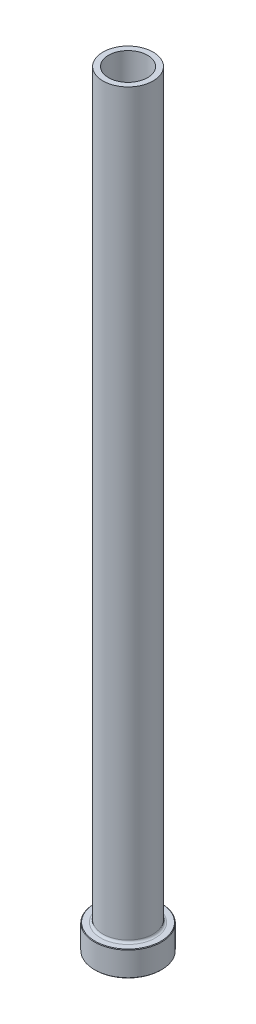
ISO-10303-21;
HEADER;
FILE_DESCRIPTION(('STEP AP214'),'2;1');
FILE_NAME('part.step','',(''),(''),'','','');
FILE_SCHEMA(('AUTOMOTIVE_DESIGN { 1 0 10303 214 1 1 1 1 }'));
ENDSEC;
DATA;
#1=APPLICATION_CONTEXT('core data for automotive mechanical design processes');
#2=APPLICATION_PROTOCOL_DEFINITION('international standard','automotive_design',2000,#1);
#3=PRODUCT_CONTEXT('',#1,'mechanical');
#4=PRODUCT('Part','Part','',(#3));
#5=PRODUCT_RELATED_PRODUCT_CATEGORY('part','',(#4));
#6=PRODUCT_DEFINITION_FORMATION('','',#4);
#7=PRODUCT_DEFINITION_CONTEXT('part definition',#1,'design');
#8=PRODUCT_DEFINITION('design','',#6,#7);
#9=PRODUCT_DEFINITION_SHAPE('','',#8);
#10=(LENGTH_UNIT() NAMED_UNIT(*) SI_UNIT(.MILLI.,.METRE.));
#11=(NAMED_UNIT(*) PLANE_ANGLE_UNIT() SI_UNIT($,.RADIAN.));
#12=(NAMED_UNIT(*) SI_UNIT($,.STERADIAN.) SOLID_ANGLE_UNIT());
#13=UNCERTAINTY_MEASURE_WITH_UNIT(LENGTH_MEASURE(1.E-05),#10,'distance_accuracy_value','');
#14=(GEOMETRIC_REPRESENTATION_CONTEXT(3) GLOBAL_UNCERTAINTY_ASSIGNED_CONTEXT((#13)) GLOBAL_UNIT_ASSIGNED_CONTEXT((#10,
#11,#12)) REPRESENTATION_CONTEXT('',''));
#15=CARTESIAN_POINT('',(0.,0.,0.));
#16=DIRECTION('',(0.,0.,1.));
#17=DIRECTION('',(1.,0.,0.));
#18=AXIS2_PLACEMENT_3D('',#15,#16,#17);
#19=CARTESIAN_POINT('',(0.,92.1876809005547,0.));
#20=DIRECTION('',(0.,1.,0.));
#21=DIRECTION('',(0.,0.,1.));
#22=AXIS2_PLACEMENT_3D('',#19,#20,#21);
#23=CYLINDRICAL_SURFACE('',#22,7.00000000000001);
#24=CARTESIAN_POINT('',(0.,275.,0.));
#25=DIRECTION('',(0.,1.,0.));
#26=DIRECTION('',(0.,0.,1.));
#27=AXIS2_PLACEMENT_3D('',#24,#25,#26);
#28=CIRCLE('',#27,7.00000000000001);
#29=CARTESIAN_POINT('',(0.,275.,7.00000000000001));
#30=VERTEX_POINT('',#29);
#31=EDGE_CURVE('E62',#30,#30,#28,.T.);
#32=ORIENTED_EDGE('',*,*,#31,.T.);
#33=EDGE_LOOP('',(#32));
#34=FACE_BOUND('',#33,.T.);
#35=CARTESIAN_POINT('',(0.,220.,0.));
#36=DIRECTION('',(0.,1.,0.));
#37=DIRECTION('',(0.,0.,1.));
#38=AXIS2_PLACEMENT_3D('',#35,#36,#37);
#39=CIRCLE('',#38,7.00000000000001);
#40=CARTESIAN_POINT('',(0.,220.,7.00000000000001));
#41=VERTEX_POINT('',#40);
#42=EDGE_CURVE('E71',#41,#41,#39,.T.);
#43=ORIENTED_EDGE('',*,*,#42,.F.);
#44=EDGE_LOOP('',(#43));
#45=FACE_BOUND('',#44,.T.);
#46=ADVANCED_FACE('F30',(#34,#45),#23,.F.);
#47=CARTESIAN_POINT('',(-7.00000000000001,275.,0.));
#48=DIRECTION('',(0.,1.,0.));
#49=DIRECTION('',(0.,0.,1.));
#50=AXIS2_PLACEMENT_3D('',#47,#48,#49);
#51=PLANE('',#50);
#52=CARTESIAN_POINT('',(0.,275.,0.));
#53=DIRECTION('',(0.,1.,0.));
#54=DIRECTION('',(0.,0.,1.));
#55=AXIS2_PLACEMENT_3D('',#52,#53,#54);
#56=CIRCLE('',#55,9.00000000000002);
#57=CARTESIAN_POINT('',(0.,275.,9.00000000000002));
#58=VERTEX_POINT('',#57);
#59=EDGE_CURVE('E65',#58,#58,#56,.T.);
#60=ORIENTED_EDGE('',*,*,#59,.T.);
#61=EDGE_LOOP('',(#60));
#62=FACE_BOUND('',#61,.T.);
#63=ORIENTED_EDGE('',*,*,#31,.F.);
#64=EDGE_LOOP('',(#63));
#65=FACE_BOUND('',#64,.T.);
#66=ADVANCED_FACE('F79',(#62,#65),#51,.T.);
#67=CARTESIAN_POINT('',(0.,92.1876809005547,0.));
#68=DIRECTION('',(0.,1.,0.));
#69=DIRECTION('',(0.,0.,1.));
#70=AXIS2_PLACEMENT_3D('',#67,#68,#69);
#71=CYLINDRICAL_SURFACE('',#70,9.00000000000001);
#72=CARTESIAN_POINT('',(0.,9.8,0.));
#73=DIRECTION('',(0.,1.,0.));
#74=DIRECTION('',(0.,0.,1.));
#75=AXIS2_PLACEMENT_3D('',#72,#73,#74);
#76=CIRCLE('',#75,9.00000000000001);
#77=CARTESIAN_POINT('',(0.,9.8,9.00000000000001));
#78=VERTEX_POINT('',#77);
#79=EDGE_CURVE('E59',#78,#78,#76,.T.);
#80=ORIENTED_EDGE('',*,*,#79,.T.);
#81=EDGE_LOOP('',(#80));
#82=FACE_BOUND('',#81,.T.);
#83=ORIENTED_EDGE('',*,*,#59,.F.);
#84=EDGE_LOOP('',(#83));
#85=FACE_BOUND('',#84,.T.);
#86=ADVANCED_FACE('F85',(#82,#85),#71,.T.);
#87=CARTESIAN_POINT('',(-8.99999999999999,9.,0.));
#88=DIRECTION('',(0.,1.,0.));
#89=DIRECTION('',(0.,0.,1.));
#90=AXIS2_PLACEMENT_3D('',#87,#88,#89);
#91=PLANE('',#90);
#92=CARTESIAN_POINT('',(0.,9.,0.));
#93=DIRECTION('',(0.,1.,0.));
#94=DIRECTION('',(0.,0.,1.));
#95=AXIS2_PLACEMENT_3D('',#92,#93,#94);
#96=CIRCLE('',#95,11.8);
#97=CARTESIAN_POINT('',(0.,9.,-11.8));
#98=VERTEX_POINT('',#97);
#99=EDGE_CURVE('E53',#98,#98,#96,.T.);
#100=ORIENTED_EDGE('',*,*,#99,.T.);
#101=EDGE_LOOP('',(#100));
#102=FACE_BOUND('',#101,.T.);
#103=CARTESIAN_POINT('',(0.,9.,0.));
#104=DIRECTION('',(0.,1.,0.));
#105=DIRECTION('',(0.,0.,1.));
#106=AXIS2_PLACEMENT_3D('',#103,#104,#105);
#107=CIRCLE('',#106,9.8);
#108=CARTESIAN_POINT('',(0.,9.,9.8));
#109=VERTEX_POINT('',#108);
#110=EDGE_CURVE('E56',#109,#109,#107,.F.);
#111=ORIENTED_EDGE('',*,*,#110,.T.);
#112=EDGE_LOOP('',(#111));
#113=FACE_BOUND('',#112,.T.);
#114=ADVANCED_FACE('F111',(#102,#113),#91,.T.);
#115=CARTESIAN_POINT('',(0.,92.1876809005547,0.));
#116=DIRECTION('',(0.,1.,0.));
#117=DIRECTION('',(0.,0.,1.));
#118=AXIS2_PLACEMENT_3D('',#115,#116,#117);
#119=CYLINDRICAL_SURFACE('',#118,12.);
#120=CARTESIAN_POINT('',(0.,8.80000000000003,0.));
#121=DIRECTION('',(0.,1.,0.));
#122=DIRECTION('',(0.,0.,1.));
#123=AXIS2_PLACEMENT_3D('',#120,#121,#122);
#124=CIRCLE('',#123,12.);
#125=CARTESIAN_POINT('',(0.,8.80000000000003,-12.));
#126=VERTEX_POINT('',#125);
#127=EDGE_CURVE('E45',#126,#126,#124,.F.);
#128=ORIENTED_EDGE('',*,*,#127,.T.);
#129=EDGE_LOOP('',(#128));
#130=FACE_BOUND('',#129,.T.);
#131=CARTESIAN_POINT('',(0.,0.200000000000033,0.));
#132=DIRECTION('',(0.,-1.,0.));
#133=DIRECTION('',(0.,0.,-1.));
#134=AXIS2_PLACEMENT_3D('',#131,#132,#133);
#135=CIRCLE('',#134,12.);
#136=CARTESIAN_POINT('',(0.,0.200000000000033,-12.));
#137=VERTEX_POINT('',#136);
#138=EDGE_CURVE('E50',#137,#137,#135,.F.);
#139=ORIENTED_EDGE('',*,*,#138,.T.);
#140=EDGE_LOOP('',(#139));
#141=FACE_BOUND('',#140,.T.);
#142=ADVANCED_FACE('F108',(#130,#141),#119,.T.);
#143=CARTESIAN_POINT('',(-12.,0.,0.));
#144=DIRECTION('',(0.,-1.,0.));
#145=DIRECTION('',(0.,0.,-1.));
#146=AXIS2_PLACEMENT_3D('',#143,#144,#145);
#147=PLANE('',#146);
#148=CARTESIAN_POINT('',(0.,0.,0.));
#149=DIRECTION('',(0.,-1.,0.));
#150=DIRECTION('',(0.,0.,-1.));
#151=AXIS2_PLACEMENT_3D('',#148,#149,#150);
#152=CIRCLE('',#151,7.74999999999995);
#153=CARTESIAN_POINT('',(0.,0.,-7.74999999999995));
#154=VERTEX_POINT('',#153);
#155=EDGE_CURVE('E37',#154,#154,#152,.F.);
#156=ORIENTED_EDGE('',*,*,#155,.T.);
#157=EDGE_LOOP('',(#156));
#158=FACE_BOUND('',#157,.T.);
#159=CARTESIAN_POINT('',(0.,0.,0.));
#160=DIRECTION('',(0.,-1.,0.));
#161=DIRECTION('',(0.,0.,-1.));
#162=AXIS2_PLACEMENT_3D('',#159,#160,#161);
#163=CIRCLE('',#162,11.8);
#164=CARTESIAN_POINT('',(0.,0.,-11.8));
#165=VERTEX_POINT('',#164);
#166=EDGE_CURVE('E41',#165,#165,#163,.T.);
#167=ORIENTED_EDGE('',*,*,#166,.T.);
#168=EDGE_LOOP('',(#167));
#169=FACE_BOUND('',#168,.T.);
#170=ADVANCED_FACE('F110',(#158,#169),#147,.T.);
#171=CARTESIAN_POINT('',(0.,92.1876809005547,0.));
#172=DIRECTION('',(0.,1.,0.));
#173=DIRECTION('',(0.,0.,1.));
#174=AXIS2_PLACEMENT_3D('',#171,#172,#173);
#175=CYLINDRICAL_SURFACE('',#174,7.25);
#176=CARTESIAN_POINT('',(0.,0.499999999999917,0.));
#177=DIRECTION('',(0.,-1.,0.));
#178=DIRECTION('',(0.,0.,-1.));
#179=AXIS2_PLACEMENT_3D('',#176,#177,#178);
#180=CIRCLE('',#179,7.25);
#181=CARTESIAN_POINT('',(0.,0.499999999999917,-7.25));
#182=VERTEX_POINT('',#181);
#183=EDGE_CURVE('E10',#182,#182,#180,.T.);
#184=ORIENTED_EDGE('',*,*,#183,.T.);
#185=EDGE_LOOP('',(#184));
#186=FACE_BOUND('',#185,.T.);
#187=CARTESIAN_POINT('',(0.,208.,0.));
#188=DIRECTION('',(0.,1.,0.));
#189=DIRECTION('',(0.,0.,1.));
#190=AXIS2_PLACEMENT_3D('',#187,#188,#189);
#191=CIRCLE('',#190,7.25000000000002);
#192=CARTESIAN_POINT('',(0.,208.,7.25000000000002));
#193=VERTEX_POINT('',#192);
#194=EDGE_CURVE('E68',#193,#193,#191,.T.);
#195=ORIENTED_EDGE('',*,*,#194,.T.);
#196=EDGE_LOOP('',(#195));
#197=FACE_BOUND('',#196,.T.);
#198=ADVANCED_FACE('F118',(#186,#197),#175,.F.);
#199=CARTESIAN_POINT('',(0.,208.,0.));
#200=DIRECTION('',(0.,-1.,0.));
#201=DIRECTION('',(0.,0.,-1.));
#202=AXIS2_PLACEMENT_3D('',#199,#200,#201);
#203=CONICAL_SURFACE('',#202,7.25000000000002,0.0208303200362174);
#204=ORIENTED_EDGE('',*,*,#42,.T.);
#205=EDGE_LOOP('',(#204));
#206=FACE_BOUND('',#205,.T.);
#207=ORIENTED_EDGE('',*,*,#194,.F.);
#208=EDGE_LOOP('',(#207));
#209=FACE_BOUND('',#208,.T.);
#210=ADVANCED_FACE('F75',(#206,#209),#203,.F.);
#211=CARTESIAN_POINT('',(0.,9.8,0.));
#212=DIRECTION('',(0.,1.,0.));
#213=DIRECTION('',(0.,0.,1.));
#214=AXIS2_PLACEMENT_3D('',#211,#212,#213);
#215=TOROIDAL_SURFACE('',#214,9.8,0.8);
#216=ORIENTED_EDGE('',*,*,#110,.F.);
#217=EDGE_LOOP('',(#216));
#218=FACE_BOUND('',#217,.T.);
#219=ORIENTED_EDGE('',*,*,#79,.F.);
#220=EDGE_LOOP('',(#219));
#221=FACE_BOUND('',#220,.T.);
#222=ADVANCED_FACE('F90',(#218,#221),#215,.F.);
#223=CARTESIAN_POINT('',(0.,9.00000000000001,0.));
#224=DIRECTION('',(0.,-1.,0.));
#225=DIRECTION('',(0.,0.,-1.));
#226=AXIS2_PLACEMENT_3D('',#223,#224,#225);
#227=CONICAL_SURFACE('',#226,11.8,0.785398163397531);
#228=CARTESIAN_POINT('',(0.,8.80000000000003,-12.));
#229=CARTESIAN_POINT('',(0.,8.80208333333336,-11.9979166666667));
#230=CARTESIAN_POINT('',(0.,8.80416666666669,-11.9958333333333));
#231=CARTESIAN_POINT('',(0.,8.80833333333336,-11.9916666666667));
#232=CARTESIAN_POINT('',(0.,8.81041666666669,-11.9895833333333));
#233=CARTESIAN_POINT('',(0.,8.81458333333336,-11.9854166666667));
#234=CARTESIAN_POINT('',(0.,8.81666666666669,-11.9833333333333));
#235=CARTESIAN_POINT('',(0.,8.82083333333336,-11.9791666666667));
#236=CARTESIAN_POINT('',(0.,8.82291666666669,-11.9770833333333));
#237=CARTESIAN_POINT('',(0.,8.82708333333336,-11.9729166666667));
#238=CARTESIAN_POINT('',(0.,8.82916666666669,-11.9708333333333));
#239=CARTESIAN_POINT('',(0.,8.83333333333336,-11.9666666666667));
#240=CARTESIAN_POINT('',(0.,8.83541666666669,-11.9645833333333));
#241=CARTESIAN_POINT('',(0.,8.83958333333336,-11.9604166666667));
#242=CARTESIAN_POINT('',(0.,8.84166666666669,-11.9583333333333));
#243=CARTESIAN_POINT('',(0.,8.84583333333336,-11.9541666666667));
#244=CARTESIAN_POINT('',(0.,8.84791666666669,-11.9520833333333));
#245=CARTESIAN_POINT('',(0.,8.85208333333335,-11.9479166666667));
#246=CARTESIAN_POINT('',(0.,8.85416666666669,-11.9458333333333));
#247=CARTESIAN_POINT('',(0.,8.85833333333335,-11.9416666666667));
#248=CARTESIAN_POINT('',(0.,8.86041666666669,-11.9395833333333));
#249=CARTESIAN_POINT('',(0.,8.86458333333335,-11.9354166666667));
#250=CARTESIAN_POINT('',(0.,8.86666666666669,-11.9333333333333));
#251=CARTESIAN_POINT('',(0.,8.87083333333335,-11.9291666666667));
#252=CARTESIAN_POINT('',(0.,8.87291666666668,-11.9270833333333));
#253=CARTESIAN_POINT('',(0.,8.87708333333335,-11.9229166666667));
#254=CARTESIAN_POINT('',(0.,8.87916666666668,-11.9208333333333));
#255=CARTESIAN_POINT('',(0.,8.88333333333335,-11.9166666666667));
#256=CARTESIAN_POINT('',(0.,8.88541666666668,-11.9145833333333));
#257=CARTESIAN_POINT('',(0.,8.88958333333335,-11.9104166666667));
#258=CARTESIAN_POINT('',(0.,8.89166666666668,-11.9083333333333));
#259=CARTESIAN_POINT('',(0.,8.89583333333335,-11.9041666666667));
#260=CARTESIAN_POINT('',(0.,8.89791666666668,-11.9020833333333));
#261=CARTESIAN_POINT('',(0.,8.90208333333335,-11.8979166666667));
#262=CARTESIAN_POINT('',(0.,8.90416666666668,-11.8958333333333));
#263=CARTESIAN_POINT('',(0.,8.90833333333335,-11.8916666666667));
#264=CARTESIAN_POINT('',(0.,8.91041666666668,-11.8895833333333));
#265=CARTESIAN_POINT('',(0.,8.91458333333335,-11.8854166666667));
#266=CARTESIAN_POINT('',(0.,8.91666666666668,-11.8833333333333));
#267=CARTESIAN_POINT('',(0.,8.92083333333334,-11.8791666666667));
#268=CARTESIAN_POINT('',(0.,8.92291666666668,-11.8770833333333));
#269=CARTESIAN_POINT('',(0.,8.92708333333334,-11.8729166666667));
#270=CARTESIAN_POINT('',(0.,8.92916666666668,-11.8708333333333));
#271=CARTESIAN_POINT('',(0.,8.93333333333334,-11.8666666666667));
#272=CARTESIAN_POINT('',(0.,8.93541666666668,-11.8645833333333));
#273=CARTESIAN_POINT('',(0.,8.93958333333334,-11.8604166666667));
#274=CARTESIAN_POINT('',(0.,8.94166666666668,-11.8583333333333));
#275=CARTESIAN_POINT('',(0.,8.94583333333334,-11.8541666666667));
#276=CARTESIAN_POINT('',(0.,8.94791666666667,-11.8520833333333));
#277=CARTESIAN_POINT('',(0.,8.95208333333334,-11.8479166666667));
#278=CARTESIAN_POINT('',(0.,8.95416666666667,-11.8458333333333));
#279=CARTESIAN_POINT('',(0.,8.95833333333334,-11.8416666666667));
#280=CARTESIAN_POINT('',(0.,8.96041666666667,-11.8395833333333));
#281=CARTESIAN_POINT('',(0.,8.96458333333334,-11.8354166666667));
#282=CARTESIAN_POINT('',(0.,8.96666666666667,-11.8333333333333));
#283=CARTESIAN_POINT('',(0.,8.97083333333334,-11.8291666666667));
#284=CARTESIAN_POINT('',(0.,8.97291666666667,-11.8270833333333));
#285=CARTESIAN_POINT('',(0.,8.97708333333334,-11.8229166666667));
#286=CARTESIAN_POINT('',(0.,8.97916666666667,-11.8208333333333));
#287=CARTESIAN_POINT('',(0.,8.98333333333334,-11.8166666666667));
#288=CARTESIAN_POINT('',(0.,8.98541666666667,-11.8145833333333));
#289=CARTESIAN_POINT('',(0.,8.98958333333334,-11.8104166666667));
#290=CARTESIAN_POINT('',(0.,8.99166666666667,-11.8083333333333));
#291=CARTESIAN_POINT('',(0.,8.99583333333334,-11.8041666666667));
#292=CARTESIAN_POINT('',(0.,8.99791666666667,-11.8020833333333));
#293=CARTESIAN_POINT('',(0.,9.,-11.8));
#294=B_SPLINE_CURVE_WITH_KNOTS('',3,(#228,#229,#230,#231,#232,#233,#234,#235,#236,#237,#238,
#239,#240,#241,#242,#243,#244,#245,#246,#247,#248,#249,#250,#251,#252,#253,#254,#255,#256,#257,
#258,#259,#260,#261,#262,#263,#264,#265,#266,#267,#268,#269,#270,#271,#272,#273,#274,#275,#276,
#277,#278,#279,#280,#281,#282,#283,#284,#285,#286,#287,#288,#289,#290,#291,#292,#293),
.UNSPECIFIED.,.F.,.F.,(4,2,2,2,2,2,2,2,2,2,2,2,2,2,2,2,2,2,2,2,2,2,2,2,2,2,2,2,2,2,2,2,4),(0.,
0.0088388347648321,0.017677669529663,0.0265165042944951,0.0353553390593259,0.044194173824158,
0.0530330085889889,0.061871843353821,0.0707106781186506,0.0795495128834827,0.0883883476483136,
0.0972271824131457,0.106066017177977,0.114904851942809,0.12374368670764,0.132582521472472,
0.141421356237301,0.150260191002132,0.159099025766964,0.167937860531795,0.176776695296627,
0.185615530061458,0.19445436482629,0.203293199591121,0.212132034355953,0.220970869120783,
0.229809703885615,0.238648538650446,0.247487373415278,0.256326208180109,0.265165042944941,
0.274003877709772,0.282842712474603),.UNSPECIFIED.);
#295=EDGE_CURVE('BSEAM93',#126,#98,#294,.T.);
#296=ORIENTED_EDGE('',*,*,#127,.F.);
#297=ORIENTED_EDGE('',*,*,#99,.F.);
#298=ORIENTED_EDGE('',*,*,#295,.T.);
#299=ORIENTED_EDGE('',*,*,#295,.F.);
#300=EDGE_LOOP('',(#296,#298,#297,#299));
#301=FACE_BOUND('',#300,.T.);
#302=ADVANCED_FACE('F93',(#301),#227,.T.);
#303=CARTESIAN_POINT('',(0.,0.200000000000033,0.));
#304=DIRECTION('',(0.,1.,0.));
#305=DIRECTION('',(0.,0.,1.));
#306=AXIS2_PLACEMENT_3D('',#303,#304,#305);
#307=CONICAL_SURFACE('',#306,12.,0.785398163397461);
#308=ORIENTED_EDGE('',*,*,#166,.F.);
#309=EDGE_LOOP('',(#308));
#310=FACE_BOUND('',#309,.T.);
#311=ORIENTED_EDGE('',*,*,#138,.F.);
#312=EDGE_LOOP('',(#311));
#313=FACE_BOUND('',#312,.T.);
#314=ADVANCED_FACE('F96',(#310,#313),#307,.T.);
#315=CARTESIAN_POINT('',(0.,0.,0.));
#316=DIRECTION('',(0.,-1.,0.));
#317=DIRECTION('',(0.,0.,-1.));
#318=AXIS2_PLACEMENT_3D('',#315,#316,#317);
#319=CONICAL_SURFACE('',#318,7.74999999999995,0.78539816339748);
#320=ORIENTED_EDGE('',*,*,#183,.F.);
#321=EDGE_LOOP('',(#320));
#322=FACE_BOUND('',#321,.T.);
#323=ORIENTED_EDGE('',*,*,#155,.F.);
#324=EDGE_LOOP('',(#323));
#325=FACE_BOUND('',#324,.T.);
#326=ADVANCED_FACE('F32',(#322,#325),#319,.F.);
#327=CLOSED_SHELL('',(#46,#66,#86,#114,#142,#170,#198,#210,#222,#302,#314,#326));
#328=MANIFOLD_SOLID_BREP('B2',#327);
#329=ADVANCED_BREP_SHAPE_REPRESENTATION('',(#18,#328),#14);
#330=SHAPE_DEFINITION_REPRESENTATION(#9,#329);
ENDSEC;
END-ISO-10303-21;
